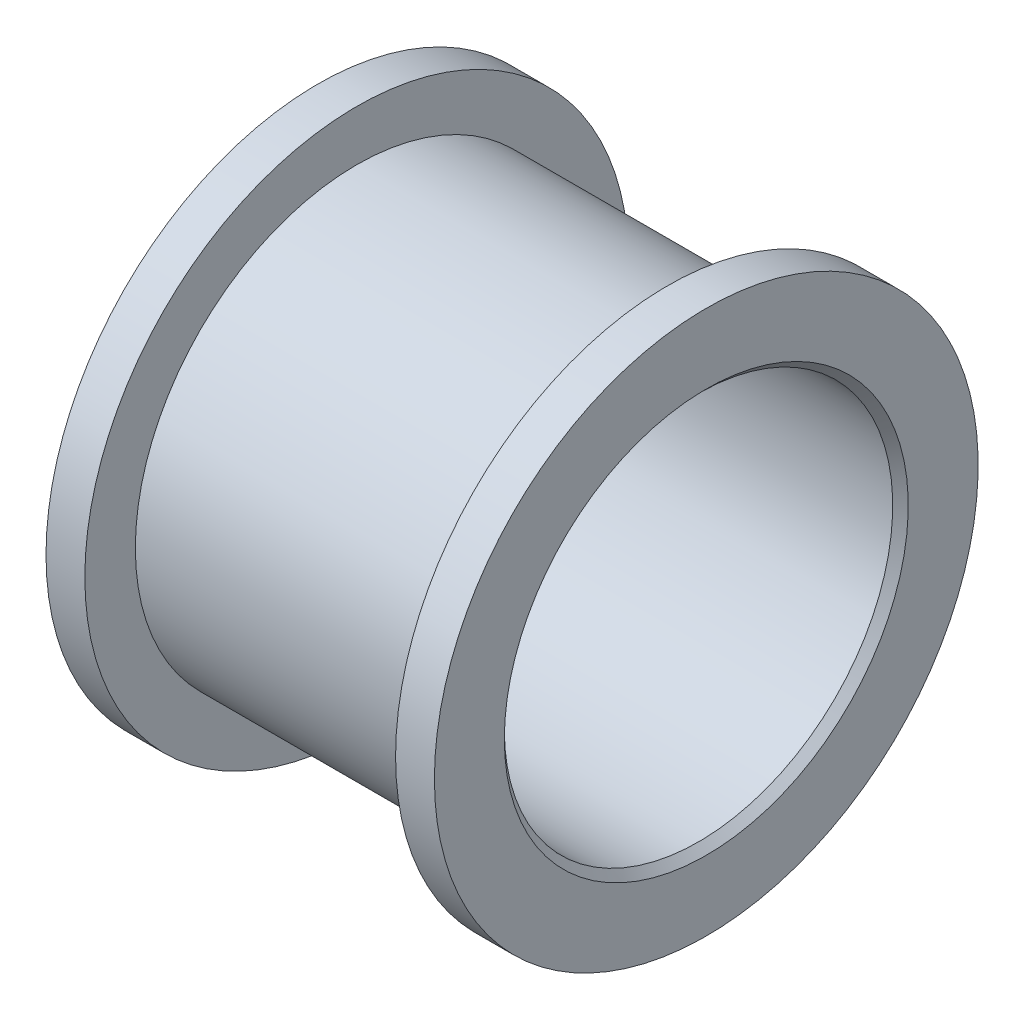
from build123d import *

# Parameters (mm, degrees)
CHANFREIN1_SIZE = 0.1


with BuildPart() as part:
    # Esquisse1 → R_volution1 (revolve)
    with BuildSketch(Plane.XY, mode=Mode.PRIVATE) as r_volution1_sk:
        Polygon((0, 2.5), (5, 2.5), (5, 3.5), (4.5, 3.5), (4.5, 2.85), (0.5, 2.85), (0.5, 3.5), (0, 3.5), align=None)
    revolve(r_volution1_sk.sketch.rotate(Axis((-47.649612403, 0, 0), (1, 0, 0)), 90), axis=Axis((-47.649612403, 0, 0), (1, 0, 0)))

    # Chanfrein1
    chanfrein1_edges = [part.edges().sort_by_distance(p)[0] for p in [
        (0, 0, -2.5),
        (5, 0, -2.5),
    ]]
    chamfer(chanfrein1_edges, length=CHANFREIN1_SIZE)


solid = part.part
